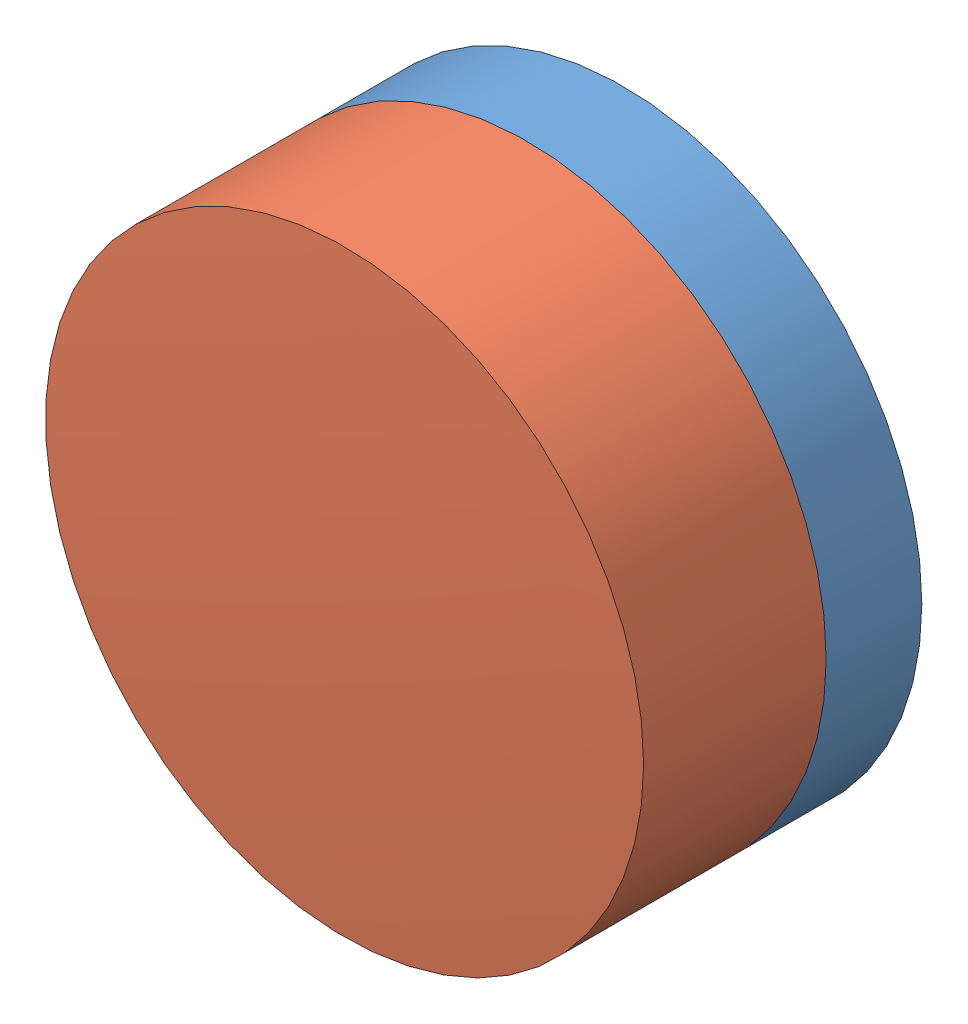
SolidWorks assembly step_45793.sldasm, configuration Default (file format 9000). Lengths in mm.
Overall size (12.94 12.23 7).
2 component instances, 2 part files, 0 mates.
Components (placement in the parent):
- 45793-1-1: 45793-1.SLDPRT [Default] at origin size (12.89 12.2 4.5)
- 45793-2-1: 45793-2.SLDPRT [Default] at origin size (12.58 12.23 5.21)
